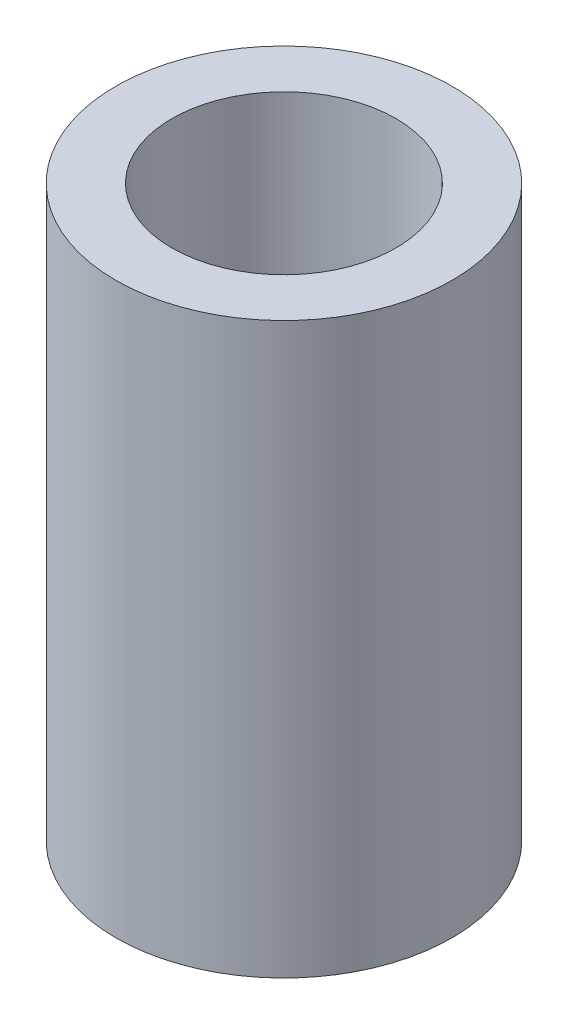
from build123d import *

# Parameters (mm, degrees)
SKETCH2_R           = 7.5
SKETCH2_R_2         = 5
BOSS_EXTRUDE1_DEPTH = 25.4


with BuildPart() as part:
    # Sketch2 → Boss-Extrude1 (new body)
    with BuildSketch(Plane(origin=(0, 0, 0), x_dir=(1, 0, 0), z_dir=(0, 1, 0))):
        with Locations(Location((0, 0, 0), (0, 0, 270))):
            Circle(SKETCH2_R)
        with Locations(Location((0, 0, 0), (0, 0, 270))):
            Circle(SKETCH2_R_2, mode=Mode.SUBTRACT)
    extrude(amount=BOSS_EXTRUDE1_DEPTH)


solid = part.part
